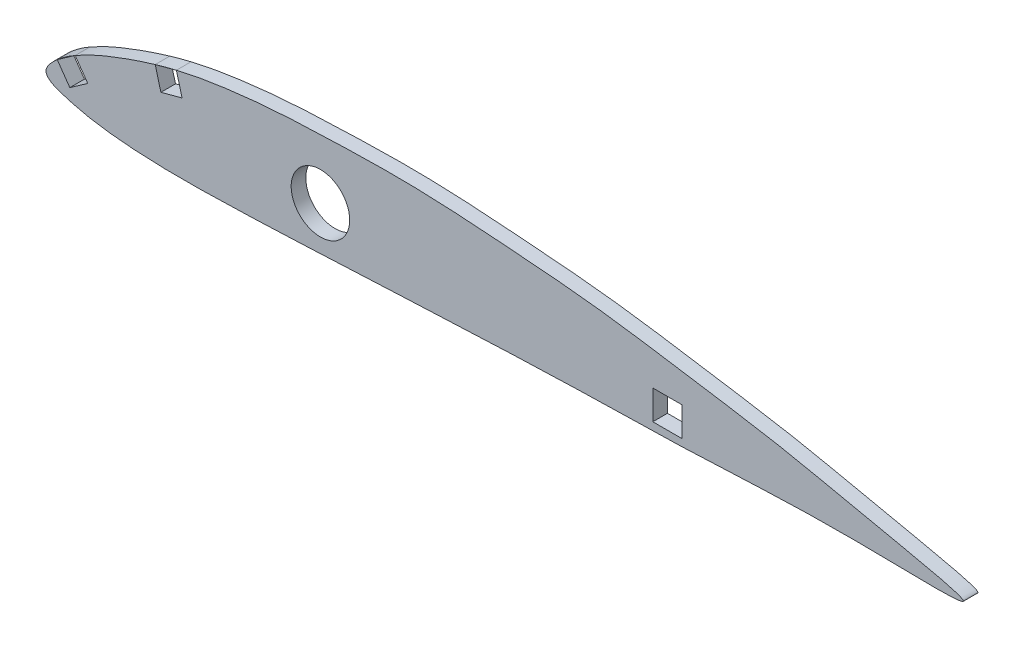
from build123d import *

# Parameters (mm, degrees)
BOSS_EXTRUDE1_DEPTH = 3.175
SKETCH1_R           = 6.35
SKETCH1_W           = 6.35
SKETCH1_H           = 6.35
CUT_EXTRUDE1_DEPTH  = 10


with BuildPart() as part:
    # 3DSketch1 → Boss-Extrude1 (new body)
    with BuildSketch(Plane(origin=(0, 0, 0), x_dir=(0.999981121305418, -0.006144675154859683, 0), z_dir=(0, 0, 1))):
        with BuildLine():
            add(Edge.make_bspline(
                [(0, 0), (-0.061412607, 1.065124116), (2.250444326, 3.471181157), (5.540326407, 5.858140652), (9.808935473, 8.190695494), (17.990116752, 11.577303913), (27.919736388, 14.812752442), (39.685113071, 16.768461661), (49.660639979, 17.825931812), (62.943768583, 18.464415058), (79.565774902, 19.038101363), (99.472011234, 17.763866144), (119.522921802, 16.325398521), (139.128762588, 13.308136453), (160.159582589, 10.225165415), (176.217648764, 6.551407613), (210.392295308, 0), (166.217996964, 1.284204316), (147.022596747, -0.591486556), (105.565603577, -1.499842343), (73.166523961, -3.464975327), (39.806557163, -5.124539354), (23.409175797, -5.494205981), (11.331507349, -4.399313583), (5.177970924, -3.032045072), (0.084274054, -1.461627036), (0, 0)],
                knots=[0, 0, 0, 0, 0.010560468, 0.018211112, 0.032209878, 0.045524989, 0.084069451, 0.108974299, 0.133649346, 0.158232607, 0.207343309, 0.256522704, 0.305826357, 0.355445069, 0.405214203, 0.45539047, 0.506006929, 0.555121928, 0.653369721, 0.702490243, 0.849938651, 0.899083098, 0.948194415, 0.97290595, 0.985508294, 1, 1, 1, 1], degree=3))
        make_face()
    extrude(amount=BOSS_EXTRUDE1_DEPTH)

    # Sketch1 → Cut-Extrude1 (cut)
    with BuildSketch(Plane.XY.offset(3.175)):
        with Locations((59.575, 5)):
            Circle(SKETCH1_R)
        Polygon((2.437761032, 3.440386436), (6.338972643, 6.172044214), (9.070630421, 2.270832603), (5.16941881, -0.460825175), align=None)
        with Locations((134.907, 3.175)):
            Rectangle(SKETCH1_W, SKETCH1_H)
        Polygon((23.705366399, 13.142547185), (28.305588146, 14.375172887), (29.538213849, 9.77495114), (24.937992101, 8.542325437), align=None)
    extrude(amount=-CUT_EXTRUDE1_DEPTH, mode=Mode.SUBTRACT)


solid = part.part
